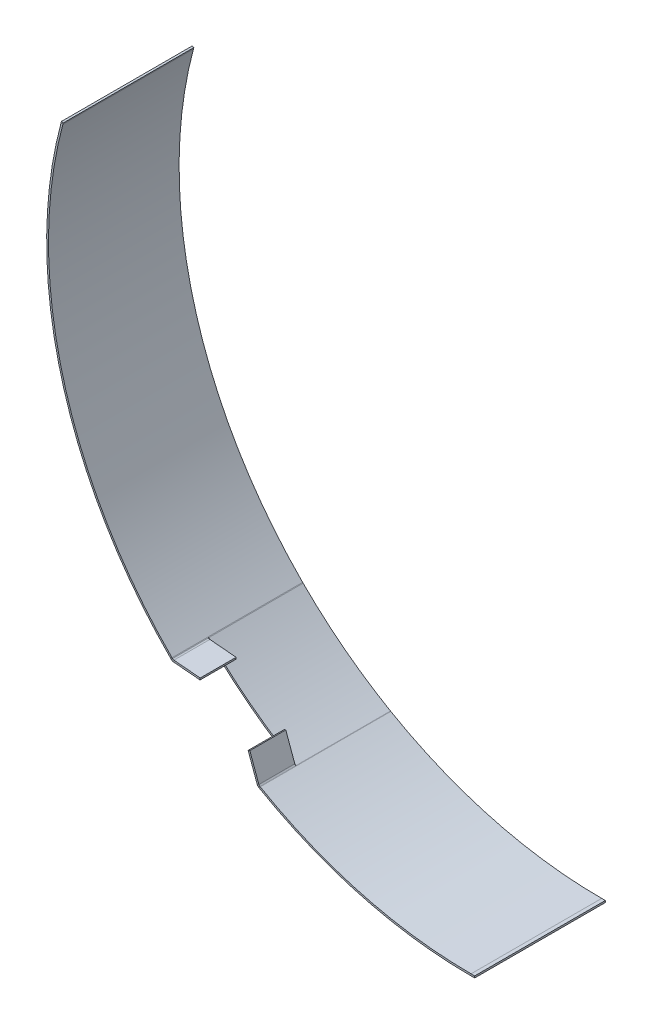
ISO-10303-21;
HEADER;
FILE_DESCRIPTION(('STEP AP214'),'2;1');
FILE_NAME('part.step','',(''),(''),'','','');
FILE_SCHEMA(('AUTOMOTIVE_DESIGN { 1 0 10303 214 1 1 1 1 }'));
ENDSEC;
DATA;
#1=APPLICATION_CONTEXT('core data for automotive mechanical design processes');
#2=APPLICATION_PROTOCOL_DEFINITION('international standard','automotive_design',2000,#1);
#3=PRODUCT_CONTEXT('',#1,'mechanical');
#4=PRODUCT('Part','Part','',(#3));
#5=PRODUCT_RELATED_PRODUCT_CATEGORY('part','',(#4));
#6=PRODUCT_DEFINITION_FORMATION('','',#4);
#7=PRODUCT_DEFINITION_CONTEXT('part definition',#1,'design');
#8=PRODUCT_DEFINITION('design','',#6,#7);
#9=PRODUCT_DEFINITION_SHAPE('','',#8);
#10=(LENGTH_UNIT() NAMED_UNIT(*) SI_UNIT(.MILLI.,.METRE.));
#11=(NAMED_UNIT(*) PLANE_ANGLE_UNIT() SI_UNIT($,.RADIAN.));
#12=(NAMED_UNIT(*) SI_UNIT($,.STERADIAN.) SOLID_ANGLE_UNIT());
#13=UNCERTAINTY_MEASURE_WITH_UNIT(LENGTH_MEASURE(1.E-05),#10,'distance_accuracy_value','');
#14=(GEOMETRIC_REPRESENTATION_CONTEXT(3) GLOBAL_UNCERTAINTY_ASSIGNED_CONTEXT((#13)) GLOBAL_UNIT_ASSIGNED_CONTEXT((#10,
#11,#12)) REPRESENTATION_CONTEXT('',''));
#15=CARTESIAN_POINT('',(0.,0.,0.));
#16=DIRECTION('',(0.,0.,1.));
#17=DIRECTION('',(1.,0.,0.));
#18=AXIS2_PLACEMENT_3D('',#15,#16,#17);
#19=CARTESIAN_POINT('',(-116.924774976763,-202.116025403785,88.9136379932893));
#20=DIRECTION('',(0.866025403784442,-0.499999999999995,0.));
#21=DIRECTION('',(0.499999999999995,0.866025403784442,0.));
#22=AXIS2_PLACEMENT_3D('',#19,#20,#21);
#23=PLANE('',#22);
#24=DIRECTION('',(-0.500000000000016,-0.866025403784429,0.));
#25=VECTOR('',#24,1.);
#26=CARTESIAN_POINT('',(-116.424774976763,-201.25,141.113637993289));
#27=LINE('',#26,#25);
#28=CARTESIAN_POINT('',(-116.424774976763,-201.25,141.113637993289));
#29=VERTEX_POINT('',#28);
#30=CARTESIAN_POINT('',(-116.924774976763,-202.116025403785,141.113637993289));
#31=VERTEX_POINT('',#30);
#32=EDGE_CURVE('E156',#29,#31,#27,.T.);
#33=ORIENTED_EDGE('',*,*,#32,.F.);
#34=DIRECTION('',(0.,0.,1.));
#35=VECTOR('',#34,1.);
#36=CARTESIAN_POINT('',(-116.424774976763,-201.25,88.9136379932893));
#37=LINE('',#36,#35);
#38=CARTESIAN_POINT('',(-116.424774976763,-201.25,140.913637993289));
#39=VERTEX_POINT('',#38);
#40=EDGE_CURVE('E480',#29,#39,#37,.F.);
#41=ORIENTED_EDGE('',*,*,#40,.T.);
#42=DIRECTION('',(-0.499999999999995,-0.866025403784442,0.));
#43=VECTOR('',#42,1.);
#44=CARTESIAN_POINT('',(-116.424774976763,-201.25,140.913637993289));
#45=LINE('',#44,#43);
#46=CARTESIAN_POINT('',(-116.924774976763,-202.116025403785,140.913637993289));
#47=VERTEX_POINT('',#46);
#48=EDGE_CURVE('E524',#39,#47,#45,.T.);
#49=ORIENTED_EDGE('',*,*,#48,.T.);
#50=DIRECTION('',(0.,0.,-1.));
#51=VECTOR('',#50,1.);
#52=CARTESIAN_POINT('',(-116.924774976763,-202.116025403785,88.9136379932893));
#53=LINE('',#52,#51);
#54=EDGE_CURVE('E496',#31,#47,#53,.T.);
#55=ORIENTED_EDGE('',*,*,#54,.F.);
#56=EDGE_LOOP('',(#33,#41,#49,#55));
#57=FACE_BOUND('',#56,.T.);
#58=ADVANCED_FACE('F131',(#57),#23,.F.);
#59=CARTESIAN_POINT('',(2.,-232.5,88.9136379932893));
#60=DIRECTION('',(0.,0.,1.));
#61=DIRECTION('',(1.,0.,0.));
#62=AXIS2_PLACEMENT_3D('',#59,#60,#61);
#63=PLANE('',#62);
#64=DIRECTION('',(0.,1.,0.));
#65=VECTOR('',#64,1.);
#66=CARTESIAN_POINT('',(0.,-232.5,88.9136379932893));
#67=LINE('',#66,#65);
#68=CARTESIAN_POINT('',(0.,-233.5,88.9136379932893));
#69=VERTEX_POINT('',#68);
#70=CARTESIAN_POINT('',(0.,-232.5,88.9136379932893));
#71=VERTEX_POINT('',#70);
#72=EDGE_CURVE('E463',#69,#71,#67,.T.);
#73=ORIENTED_EDGE('',*,*,#72,.T.);
#74=DIRECTION('',(-1.,0.,0.));
#75=VECTOR('',#74,1.);
#76=CARTESIAN_POINT('',(2.,-232.5,88.9136379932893));
#77=LINE('',#76,#75);
#78=CARTESIAN_POINT('',(2.,-232.5,88.9136379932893));
#79=VERTEX_POINT('',#78);
#80=EDGE_CURVE('E13',#79,#71,#77,.T.);
#81=ORIENTED_EDGE('',*,*,#80,.F.);
#82=DIRECTION('',(0.,1.,0.));
#83=VECTOR('',#82,1.);
#84=CARTESIAN_POINT('',(2.,-232.5,88.9136379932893));
#85=LINE('',#84,#83);
#86=CARTESIAN_POINT('',(2.,-233.5,88.9136379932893));
#87=VERTEX_POINT('',#86);
#88=EDGE_CURVE('E548',#87,#79,#85,.T.);
#89=ORIENTED_EDGE('',*,*,#88,.F.);
#90=DIRECTION('',(-1.,0.,0.));
#91=VECTOR('',#90,1.);
#92=CARTESIAN_POINT('',(2.,-233.5,88.9136379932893));
#93=LINE('',#92,#91);
#94=EDGE_CURVE('E471',#87,#69,#93,.T.);
#95=ORIENTED_EDGE('',*,*,#94,.T.);
#96=EDGE_LOOP('',(#73,#81,#89,#95));
#97=FACE_BOUND('',#96,.T.);
#98=ADVANCED_FACE('F133',(#97),#63,.F.);
#99=CARTESIAN_POINT('',(2.,-232.5,88.9136379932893));
#100=DIRECTION('',(0.,-1.,0.));
#101=DIRECTION('',(0.,0.,-1.));
#102=AXIS2_PLACEMENT_3D('',#99,#100,#101);
#103=PLANE('',#102);
#104=DIRECTION('',(0.,0.,1.));
#105=VECTOR('',#104,1.);
#106=CARTESIAN_POINT('',(0.,-232.5,88.9136379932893));
#107=LINE('',#106,#105);
#108=CARTESIAN_POINT('',(0.,-232.5,160.913637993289));
#109=VERTEX_POINT('',#108);
#110=EDGE_CURVE('E454',#71,#109,#107,.T.);
#111=ORIENTED_EDGE('',*,*,#110,.T.);
#112=DIRECTION('',(-1.,0.,0.));
#113=VECTOR('',#112,1.);
#114=CARTESIAN_POINT('',(2.,-232.5,160.913637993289));
#115=LINE('',#114,#113);
#116=CARTESIAN_POINT('',(2.,-232.5,160.913637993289));
#117=VERTEX_POINT('',#116);
#118=EDGE_CURVE('E140',#117,#109,#115,.T.);
#119=ORIENTED_EDGE('',*,*,#118,.F.);
#120=DIRECTION('',(0.,0.,1.));
#121=VECTOR('',#120,1.);
#122=CARTESIAN_POINT('',(2.,-232.5,88.9136379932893));
#123=LINE('',#122,#121);
#124=EDGE_CURVE('E551',#79,#117,#123,.T.);
#125=ORIENTED_EDGE('',*,*,#124,.F.);
#126=ORIENTED_EDGE('',*,*,#80,.T.);
#127=EDGE_LOOP('',(#111,#119,#125,#126));
#128=FACE_BOUND('',#127,.T.);
#129=ADVANCED_FACE('F408',(#128),#103,.F.);
#130=CARTESIAN_POINT('',(2.,-232.5,160.913637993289));
#131=DIRECTION('',(0.,0.,-1.));
#132=DIRECTION('',(-1.,0.,0.));
#133=AXIS2_PLACEMENT_3D('',#130,#131,#132);
#134=PLANE('',#133);
#135=DIRECTION('',(0.,-1.,0.));
#136=VECTOR('',#135,1.);
#137=CARTESIAN_POINT('',(0.,-232.5,160.913637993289));
#138=LINE('',#137,#136);
#139=CARTESIAN_POINT('',(0.,-233.5,160.913637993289));
#140=VERTEX_POINT('',#139);
#141=EDGE_CURVE('E462',#109,#140,#138,.T.);
#142=ORIENTED_EDGE('',*,*,#141,.T.);
#143=DIRECTION('',(-1.,0.,0.));
#144=VECTOR('',#143,1.);
#145=CARTESIAN_POINT('',(2.,-233.5,160.913637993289));
#146=LINE('',#145,#144);
#147=CARTESIAN_POINT('',(2.,-233.5,160.913637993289));
#148=VERTEX_POINT('',#147);
#149=EDGE_CURVE('E469',#148,#140,#146,.T.);
#150=ORIENTED_EDGE('',*,*,#149,.F.);
#151=DIRECTION('',(0.,-1.,0.));
#152=VECTOR('',#151,1.);
#153=CARTESIAN_POINT('',(2.,-232.5,160.913637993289));
#154=LINE('',#153,#152);
#155=EDGE_CURVE('E468',#117,#148,#154,.T.);
#156=ORIENTED_EDGE('',*,*,#155,.F.);
#157=ORIENTED_EDGE('',*,*,#118,.T.);
#158=EDGE_LOOP('',(#142,#150,#156,#157));
#159=FACE_BOUND('',#158,.T.);
#160=ADVANCED_FACE('F444',(#159),#134,.F.);
#161=CARTESIAN_POINT('',(2.,-233.5,88.9136379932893));
#162=DIRECTION('',(0.,1.,0.));
#163=DIRECTION('',(0.,0.,1.));
#164=AXIS2_PLACEMENT_3D('',#161,#162,#163);
#165=PLANE('',#164);
#166=DIRECTION('',(0.,0.,-1.));
#167=VECTOR('',#166,1.);
#168=CARTESIAN_POINT('',(0.,-233.5,88.9136379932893));
#169=LINE('',#168,#167);
#170=EDGE_CURVE('E545',#140,#69,#169,.T.);
#171=ORIENTED_EDGE('',*,*,#170,.T.);
#172=ORIENTED_EDGE('',*,*,#94,.F.);
#173=DIRECTION('',(0.,0.,-1.));
#174=VECTOR('',#173,1.);
#175=CARTESIAN_POINT('',(2.,-233.5,88.9136379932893));
#176=LINE('',#175,#174);
#177=EDGE_CURVE('E554',#148,#87,#176,.T.);
#178=ORIENTED_EDGE('',*,*,#177,.F.);
#179=ORIENTED_EDGE('',*,*,#149,.T.);
#180=EDGE_LOOP('',(#171,#172,#178,#179));
#181=FACE_BOUND('',#180,.T.);
#182=ADVANCED_FACE('F440',(#181),#165,.F.);
#183=CARTESIAN_POINT('',(2.,-233.5,88.9136379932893));
#184=DIRECTION('',(-1.,0.,0.));
#185=DIRECTION('',(0.,0.,1.));
#186=AXIS2_PLACEMENT_3D('',#183,#184,#185);
#187=PLANE('',#186);
#188=ORIENTED_EDGE('',*,*,#88,.T.);
#189=ORIENTED_EDGE('',*,*,#124,.T.);
#190=ORIENTED_EDGE('',*,*,#155,.T.);
#191=ORIENTED_EDGE('',*,*,#177,.T.);
#192=EDGE_LOOP('',(#188,#189,#190,#191));
#193=FACE_BOUND('',#192,.T.);
#194=ADVANCED_FACE('F433',(#193),#187,.F.);
#195=CARTESIAN_POINT('',(0.,0.,88.9136379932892));
#196=DIRECTION('',(0.,0.,-1.));
#197=DIRECTION('',(0.,1.,0.));
#198=AXIS2_PLACEMENT_3D('',#195,#196,#197);
#199=PLANE('',#198);
#200=DIRECTION('',(0.499999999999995,0.866025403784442,0.));
#201=VECTOR('',#200,1.);
#202=CARTESIAN_POINT('',(-116.749999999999,-202.216931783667,88.9136379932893));
#203=LINE('',#202,#201);
#204=CARTESIAN_POINT('',(-116.249999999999,-201.350906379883,88.9136379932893));
#205=VERTEX_POINT('',#204);
#206=CARTESIAN_POINT('',(-116.749999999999,-202.216931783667,88.9136379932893));
#207=VERTEX_POINT('',#206);
#208=EDGE_CURVE('E520',#205,#207,#203,.F.);
#209=ORIENTED_EDGE('',*,*,#208,.F.);
#210=CARTESIAN_POINT('',(0.,0.,88.9136379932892));
#211=DIRECTION('',(0.,0.,1.));
#212=DIRECTION('',(0.,-1.,0.));
#213=AXIS2_PLACEMENT_3D('',#210,#211,#212);
#214=CIRCLE('',#213,232.5);
#215=EDGE_CURVE('E533',#71,#205,#214,.F.);
#216=ORIENTED_EDGE('',*,*,#215,.F.);
#217=ORIENTED_EDGE('',*,*,#72,.F.);
#218=CARTESIAN_POINT('',(0.,0.,88.9136379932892));
#219=DIRECTION('',(0.,0.,1.));
#220=DIRECTION('',(0.,-1.,0.));
#221=AXIS2_PLACEMENT_3D('',#218,#219,#220);
#222=CIRCLE('',#221,233.5);
#223=EDGE_CURVE('E539',#69,#207,#222,.F.);
#224=ORIENTED_EDGE('',*,*,#223,.T.);
#225=EDGE_LOOP('',(#209,#216,#217,#224));
#226=FACE_BOUND('',#225,.T.);
#227=ADVANCED_FACE('F430',(#226),#199,.T.);
#228=CARTESIAN_POINT('',(0.,0.,160.913637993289));
#229=DIRECTION('',(0.,0.,-1.));
#230=DIRECTION('',(0.,1.,0.));
#231=AXIS2_PLACEMENT_3D('',#228,#229,#230);
#232=PLANE('',#231);
#233=CARTESIAN_POINT('',(0.,0.,160.913637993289));
#234=DIRECTION('',(0.,0.,1.));
#235=DIRECTION('',(0.,-1.,0.));
#236=AXIS2_PLACEMENT_3D('',#233,#234,#235);
#237=CIRCLE('',#236,232.5);
#238=CARTESIAN_POINT('',(-116.249999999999,-201.350906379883,160.913637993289));
#239=VERTEX_POINT('',#238);
#240=EDGE_CURVE('E536',#239,#109,#237,.T.);
#241=ORIENTED_EDGE('',*,*,#240,.F.);
#242=DIRECTION('',(0.499999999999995,0.866025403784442,0.));
#243=VECTOR('',#242,1.);
#244=CARTESIAN_POINT('',(-116.249999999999,-201.350906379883,160.913637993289));
#245=LINE('',#244,#243);
#246=CARTESIAN_POINT('',(-116.749999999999,-202.216931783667,160.913637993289));
#247=VERTEX_POINT('',#246);
#248=EDGE_CURVE('E526',#239,#247,#245,.F.);
#249=ORIENTED_EDGE('',*,*,#248,.T.);
#250=CARTESIAN_POINT('',(0.,0.,160.913637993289));
#251=DIRECTION('',(0.,0.,1.));
#252=DIRECTION('',(0.,-1.,0.));
#253=AXIS2_PLACEMENT_3D('',#250,#251,#252);
#254=CIRCLE('',#253,233.5);
#255=EDGE_CURVE('E535',#247,#140,#254,.T.);
#256=ORIENTED_EDGE('',*,*,#255,.T.);
#257=ORIENTED_EDGE('',*,*,#141,.F.);
#258=EDGE_LOOP('',(#241,#249,#256,#257));
#259=FACE_BOUND('',#258,.T.);
#260=ADVANCED_FACE('F426',(#259),#232,.F.);
#261=CARTESIAN_POINT('',(0.,0.,160.913637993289));
#262=DIRECTION('',(0.,0.,1.));
#263=DIRECTION('',(-0.499999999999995,-0.866025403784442,0.));
#264=AXIS2_PLACEMENT_3D('',#261,#262,#263);
#265=CYLINDRICAL_SURFACE('',#264,233.5);
#266=ORIENTED_EDGE('',*,*,#170,.F.);
#267=ORIENTED_EDGE('',*,*,#255,.F.);
#268=DIRECTION('',(0.,0.,1.));
#269=VECTOR('',#268,1.);
#270=CARTESIAN_POINT('',(-116.749999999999,-202.216931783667,88.9136379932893));
#271=LINE('',#270,#269);
#272=EDGE_CURVE('E513',#247,#207,#271,.F.);
#273=ORIENTED_EDGE('',*,*,#272,.T.);
#274=ORIENTED_EDGE('',*,*,#223,.F.);
#275=EDGE_LOOP('',(#266,#267,#273,#274));
#276=FACE_BOUND('',#275,.T.);
#277=ADVANCED_FACE('F424',(#276),#265,.T.);
#278=CARTESIAN_POINT('',(0.,0.,160.913637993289));
#279=DIRECTION('',(0.,0.,1.));
#280=DIRECTION('',(-0.499999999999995,-0.866025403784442,0.));
#281=AXIS2_PLACEMENT_3D('',#278,#279,#280);
#282=CYLINDRICAL_SURFACE('',#281,232.5);
#283=ORIENTED_EDGE('',*,*,#110,.F.);
#284=ORIENTED_EDGE('',*,*,#215,.T.);
#285=DIRECTION('',(0.,0.,1.));
#286=VECTOR('',#285,1.);
#287=CARTESIAN_POINT('',(-116.249999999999,-201.350906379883,88.9136379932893));
#288=LINE('',#287,#286);
#289=EDGE_CURVE('E523',#205,#239,#288,.T.);
#290=ORIENTED_EDGE('',*,*,#289,.T.);
#291=ORIENTED_EDGE('',*,*,#240,.T.);
#292=EDGE_LOOP('',(#283,#284,#290,#291));
#293=FACE_BOUND('',#292,.T.);
#294=ADVANCED_FACE('F420',(#293),#282,.F.);
#295=CARTESIAN_POINT('',(-62.7981872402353,-233.366025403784,88.9136379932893));
#296=DIRECTION('',(0.,0.,1.));
#297=DIRECTION('',(1.,0.,0.));
#298=AXIS2_PLACEMENT_3D('',#295,#296,#297);
#299=PLANE('',#298);
#300=ORIENTED_EDGE('',*,*,#208,.T.);
#301=DIRECTION('',(0.866025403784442,-0.499999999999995,0.));
#302=VECTOR('',#301,1.);
#303=CARTESIAN_POINT('',(-116.924774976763,-202.116025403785,88.9136379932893));
#304=LINE('',#303,#302);
#305=CARTESIAN_POINT('',(-116.924774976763,-202.116025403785,88.9136379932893));
#306=VERTEX_POINT('',#305);
#307=EDGE_CURVE('E479',#306,#207,#304,.T.);
#308=ORIENTED_EDGE('',*,*,#307,.F.);
#309=DIRECTION('',(0.499999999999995,0.866025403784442,0.));
#310=VECTOR('',#309,1.);
#311=CARTESIAN_POINT('',(-116.924774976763,-202.116025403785,88.9136379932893));
#312=LINE('',#311,#310);
#313=CARTESIAN_POINT('',(-116.424774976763,-201.25,88.9136379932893));
#314=VERTEX_POINT('',#313);
#315=EDGE_CURVE('E503',#306,#314,#312,.T.);
#316=ORIENTED_EDGE('',*,*,#315,.T.);
#317=DIRECTION('',(-0.866025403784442,0.499999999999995,0.));
#318=VECTOR('',#317,1.);
#319=CARTESIAN_POINT('',(-62.2981872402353,-232.5,88.9136379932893));
#320=LINE('',#319,#318);
#321=EDGE_CURVE('E521',#314,#205,#320,.F.);
#322=ORIENTED_EDGE('',*,*,#321,.T.);
#323=EDGE_LOOP('',(#300,#308,#316,#322));
#324=FACE_BOUND('',#323,.T.);
#325=ADVANCED_FACE('F416',(#324),#299,.F.);
#326=CARTESIAN_POINT('',(-116.924774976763,-202.116025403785,160.913637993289));
#327=DIRECTION('',(0.,0.,-1.));
#328=DIRECTION('',(-1.,0.,0.));
#329=AXIS2_PLACEMENT_3D('',#326,#327,#328);
#330=PLANE('',#329);
#331=ORIENTED_EDGE('',*,*,#248,.F.);
#332=DIRECTION('',(0.866025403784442,-0.499999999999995,0.));
#333=VECTOR('',#332,1.);
#334=CARTESIAN_POINT('',(-116.424774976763,-201.25,160.913637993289));
#335=LINE('',#334,#333);
#336=CARTESIAN_POINT('',(-116.424774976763,-201.25,160.913637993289));
#337=VERTEX_POINT('',#336);
#338=EDGE_CURVE('E488',#239,#337,#335,.F.);
#339=ORIENTED_EDGE('',*,*,#338,.T.);
#340=DIRECTION('',(0.499999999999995,0.866025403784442,0.));
#341=VECTOR('',#340,1.);
#342=CARTESIAN_POINT('',(-116.924774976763,-202.116025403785,160.913637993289));
#343=LINE('',#342,#341);
#344=CARTESIAN_POINT('',(-116.924774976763,-202.116025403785,160.913637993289));
#345=VERTEX_POINT('',#344);
#346=EDGE_CURVE('E538',#345,#337,#343,.T.);
#347=ORIENTED_EDGE('',*,*,#346,.F.);
#348=DIRECTION('',(-0.866025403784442,0.499999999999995,0.));
#349=VECTOR('',#348,1.);
#350=CARTESIAN_POINT('',(-116.924774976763,-202.116025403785,160.913637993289));
#351=LINE('',#350,#349);
#352=EDGE_CURVE('E498',#247,#345,#351,.T.);
#353=ORIENTED_EDGE('',*,*,#352,.F.);
#354=EDGE_LOOP('',(#331,#339,#347,#353));
#355=FACE_BOUND('',#354,.T.);
#356=ADVANCED_FACE('F414',(#355),#330,.F.);
#357=CARTESIAN_POINT('',(-116.924774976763,-202.116025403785,88.9136379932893));
#358=DIRECTION('',(0.499999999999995,0.866025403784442,0.));
#359=DIRECTION('',(-0.866025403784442,0.499999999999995,0.));
#360=AXIS2_PLACEMENT_3D('',#357,#358,#359);
#361=PLANE('',#360);
#362=ORIENTED_EDGE('',*,*,#272,.F.);
#363=ORIENTED_EDGE('',*,*,#352,.T.);
#364=EDGE_CURVE('E481',#345,#31,#53,.T.);
#365=ORIENTED_EDGE('',*,*,#364,.T.);
#366=ORIENTED_EDGE('',*,*,#54,.T.);
#367=DIRECTION('',(0.,0.,1.));
#368=VECTOR('',#367,1.);
#369=CARTESIAN_POINT('',(-116.924774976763,-202.116025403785,140.913637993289));
#370=LINE('',#369,#368);
#371=EDGE_CURVE('E515',#47,#306,#370,.F.);
#372=ORIENTED_EDGE('',*,*,#371,.T.);
#373=ORIENTED_EDGE('',*,*,#307,.T.);
#374=EDGE_LOOP('',(#362,#363,#365,#366,#372,#373));
#375=FACE_BOUND('',#374,.T.);
#376=ADVANCED_FACE('F412',(#375),#361,.F.);
#377=CARTESIAN_POINT('',(-116.424774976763,-201.25,88.9136379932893));
#378=DIRECTION('',(0.499999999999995,0.866025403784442,0.));
#379=DIRECTION('',(-0.866025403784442,0.499999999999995,0.));
#380=AXIS2_PLACEMENT_3D('',#377,#378,#379);
#381=PLANE('',#380);
#382=ORIENTED_EDGE('',*,*,#338,.F.);
#383=ORIENTED_EDGE('',*,*,#289,.F.);
#384=ORIENTED_EDGE('',*,*,#321,.F.);
#385=DIRECTION('',(0.,0.,1.));
#386=VECTOR('',#385,1.);
#387=CARTESIAN_POINT('',(-116.424774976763,-201.25,140.913637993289));
#388=LINE('',#387,#386);
#389=EDGE_CURVE('E631',#39,#314,#388,.F.);
#390=ORIENTED_EDGE('',*,*,#389,.F.);
#391=ORIENTED_EDGE('',*,*,#40,.F.);
#392=EDGE_CURVE('E475',#337,#29,#37,.F.);
#393=ORIENTED_EDGE('',*,*,#392,.F.);
#394=EDGE_LOOP('',(#382,#383,#384,#390,#391,#393));
#395=FACE_BOUND('',#394,.T.);
#396=ADVANCED_FACE('F570',(#395),#381,.T.);
#397=CARTESIAN_POINT('',(-0.17477497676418,0.100906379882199,88.9136379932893));
#398=DIRECTION('',(0.,0.,-1.));
#399=DIRECTION('',(-1.,0.,0.));
#400=AXIS2_PLACEMENT_3D('',#397,#398,#399);
#401=PLANE('',#400);
#402=DIRECTION('',(0.707106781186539,0.707106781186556,0.));
#403=VECTOR('',#402,1.);
#404=CARTESIAN_POINT('',(-165.284208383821,-165.008527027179,88.9136379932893));
#405=LINE('',#404,#403);
#406=CARTESIAN_POINT('',(-164.577101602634,-164.301420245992,88.9136379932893));
#407=VERTEX_POINT('',#406);
#408=CARTESIAN_POINT('',(-165.284208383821,-165.008527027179,88.9136379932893));
#409=VERTEX_POINT('',#408);
#410=EDGE_CURVE('E624',#407,#409,#405,.F.);
#411=ORIENTED_EDGE('',*,*,#410,.F.);
#412=CARTESIAN_POINT('',(-0.17477497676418,0.100906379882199,88.9136379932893));
#413=DIRECTION('',(0.,0.,1.));
#414=DIRECTION('',(1.,0.,0.));
#415=AXIS2_PLACEMENT_3D('',#412,#413,#414);
#416=CIRCLE('',#415,232.5);
#417=EDGE_CURVE('E627',#314,#407,#416,.F.);
#418=ORIENTED_EDGE('',*,*,#417,.F.);
#419=ORIENTED_EDGE('',*,*,#315,.F.);
#420=CARTESIAN_POINT('',(-0.17477497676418,0.100906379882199,88.9136379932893));
#421=DIRECTION('',(0.,0.,1.));
#422=DIRECTION('',(1.,0.,0.));
#423=AXIS2_PLACEMENT_3D('',#420,#421,#422);
#424=CIRCLE('',#423,233.5);
#425=EDGE_CURVE('E529',#306,#409,#424,.F.);
#426=ORIENTED_EDGE('',*,*,#425,.T.);
#427=EDGE_LOOP('',(#411,#418,#419,#426));
#428=FACE_BOUND('',#427,.T.);
#429=ADVANCED_FACE('F648',(#428),#401,.T.);
#430=CARTESIAN_POINT('',(-0.174774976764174,0.100906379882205,140.913637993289));
#431=DIRECTION('',(0.,0.,-1.));
#432=DIRECTION('',(-1.,0.,0.));
#433=AXIS2_PLACEMENT_3D('',#430,#431,#432);
#434=PLANE('',#433);
#435=CARTESIAN_POINT('',(-0.174774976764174,0.100906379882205,140.913637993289));
#436=DIRECTION('',(0.,0.,1.));
#437=DIRECTION('',(1.,0.,0.));
#438=AXIS2_PLACEMENT_3D('',#435,#436,#437);
#439=CIRCLE('',#438,232.5);
#440=CARTESIAN_POINT('',(-164.577101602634,-164.301420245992,140.913637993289));
#441=VERTEX_POINT('',#440);
#442=EDGE_CURVE('E604',#441,#39,#439,.T.);
#443=ORIENTED_EDGE('',*,*,#442,.F.);
#444=DIRECTION('',(0.707106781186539,0.707106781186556,0.));
#445=VECTOR('',#444,1.);
#446=CARTESIAN_POINT('',(-164.577101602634,-164.301420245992,140.913637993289));
#447=LINE('',#446,#445);
#448=CARTESIAN_POINT('',(-165.284208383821,-165.008527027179,140.913637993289));
#449=VERTEX_POINT('',#448);
#450=EDGE_CURVE('E618',#441,#449,#447,.F.);
#451=ORIENTED_EDGE('',*,*,#450,.T.);
#452=CARTESIAN_POINT('',(-0.174774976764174,0.100906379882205,140.913637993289));
#453=DIRECTION('',(0.,0.,1.));
#454=DIRECTION('',(1.,0.,0.));
#455=AXIS2_PLACEMENT_3D('',#452,#453,#454);
#456=CIRCLE('',#455,233.5);
#457=EDGE_CURVE('E630',#449,#47,#456,.T.);
#458=ORIENTED_EDGE('',*,*,#457,.T.);
#459=ORIENTED_EDGE('',*,*,#48,.F.);
#460=EDGE_LOOP('',(#443,#451,#458,#459));
#461=FACE_BOUND('',#460,.T.);
#462=ADVANCED_FACE('F1013',(#461),#434,.F.);
#463=CARTESIAN_POINT('',(-0.174774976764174,0.100906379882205,140.913637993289));
#464=DIRECTION('',(0.,0.,1.));
#465=DIRECTION('',(-0.707106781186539,-0.707106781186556,0.));
#466=AXIS2_PLACEMENT_3D('',#463,#464,#465);
#467=CYLINDRICAL_SURFACE('',#466,233.5);
#468=ORIENTED_EDGE('',*,*,#371,.F.);
#469=ORIENTED_EDGE('',*,*,#457,.F.);
#470=DIRECTION('',(0.,0.,1.));
#471=VECTOR('',#470,1.);
#472=CARTESIAN_POINT('',(-165.284208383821,-165.008527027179,88.9136379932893));
#473=LINE('',#472,#471);
#474=EDGE_CURVE('E616',#449,#409,#473,.F.);
#475=ORIENTED_EDGE('',*,*,#474,.T.);
#476=ORIENTED_EDGE('',*,*,#425,.F.);
#477=EDGE_LOOP('',(#468,#469,#475,#476));
#478=FACE_BOUND('',#477,.T.);
#479=ADVANCED_FACE('F1011',(#478),#467,.T.);
#480=CARTESIAN_POINT('',(-0.174774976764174,0.100906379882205,140.913637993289));
#481=DIRECTION('',(0.,0.,1.));
#482=DIRECTION('',(-0.707106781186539,-0.707106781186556,0.));
#483=AXIS2_PLACEMENT_3D('',#480,#481,#482);
#484=CYLINDRICAL_SURFACE('',#483,232.5);
#485=ORIENTED_EDGE('',*,*,#389,.T.);
#486=ORIENTED_EDGE('',*,*,#417,.T.);
#487=DIRECTION('',(0.,0.,1.));
#488=VECTOR('',#487,1.);
#489=CARTESIAN_POINT('',(-164.577101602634,-164.301420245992,88.9136379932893));
#490=LINE('',#489,#488);
#491=EDGE_CURVE('E621',#407,#441,#490,.T.);
#492=ORIENTED_EDGE('',*,*,#491,.T.);
#493=ORIENTED_EDGE('',*,*,#442,.T.);
#494=EDGE_LOOP('',(#485,#486,#492,#493));
#495=FACE_BOUND('',#494,.T.);
#496=ADVANCED_FACE('F644',(#495),#484,.F.);
#497=CARTESIAN_POINT('',(-143.640231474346,-186.652503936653,88.9136379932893));
#498=DIRECTION('',(0.,0.,1.));
#499=DIRECTION('',(1.,0.,0.));
#500=AXIS2_PLACEMENT_3D('',#497,#498,#499);
#501=PLANE('',#500);
#502=ORIENTED_EDGE('',*,*,#410,.T.);
#503=DIRECTION('',(0.707106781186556,-0.707106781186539,0.));
#504=VECTOR('',#503,1.);
#505=CARTESIAN_POINT('',(-143.640231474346,-186.652503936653,88.9136379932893));
#506=LINE('',#505,#504);
#507=CARTESIAN_POINT('',(-165.56054169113,-164.73219371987,88.9136379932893));
#508=VERTEX_POINT('',#507);
#509=EDGE_CURVE('E605',#508,#409,#506,.T.);
#510=ORIENTED_EDGE('',*,*,#509,.F.);
#511=DIRECTION('',(0.707106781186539,0.707106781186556,0.));
#512=VECTOR('',#511,1.);
#513=CARTESIAN_POINT('',(-165.56054169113,-164.73219371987,88.9136379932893));
#514=LINE('',#513,#512);
#515=CARTESIAN_POINT('',(-164.853434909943,-164.025086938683,88.9136379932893));
#516=VERTEX_POINT('',#515);
#517=EDGE_CURVE('E601',#508,#516,#514,.T.);
#518=ORIENTED_EDGE('',*,*,#517,.T.);
#519=DIRECTION('',(-0.707106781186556,0.707106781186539,0.));
#520=VECTOR('',#519,1.);
#521=CARTESIAN_POINT('',(-142.93312469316,-185.945397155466,88.9136379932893));
#522=LINE('',#521,#520);
#523=EDGE_CURVE('E611',#516,#407,#522,.F.);
#524=ORIENTED_EDGE('',*,*,#523,.T.);
#525=EDGE_LOOP('',(#502,#510,#518,#524));
#526=FACE_BOUND('',#525,.T.);
#527=ADVANCED_FACE('F652',(#526),#501,.F.);
#528=CARTESIAN_POINT('',(-143.640231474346,-186.652503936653,88.9136379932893));
#529=DIRECTION('',(0.707106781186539,0.707106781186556,0.));
#530=DIRECTION('',(-0.707106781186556,0.707106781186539,0.));
#531=AXIS2_PLACEMENT_3D('',#528,#529,#530);
#532=PLANE('',#531);
#533=ORIENTED_EDGE('',*,*,#474,.F.);
#534=DIRECTION('',(0.,0.,-1.));
#535=VECTOR('',#534,1.);
#536=CARTESIAN_POINT('',(-165.284208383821,-165.008527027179,160.913637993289));
#537=LINE('',#536,#535);
#538=CARTESIAN_POINT('',(-165.284208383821,-165.008527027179,141.113637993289));
#539=VERTEX_POINT('',#538);
#540=EDGE_CURVE('E703',#539,#449,#537,.T.);
#541=ORIENTED_EDGE('',*,*,#540,.F.);
#542=CARTESIAN_POINT('',(-165.284208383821,-165.008527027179,160.913637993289));
#543=VERTEX_POINT('',#542);
#544=EDGE_CURVE('E705',#543,#539,#537,.T.);
#545=ORIENTED_EDGE('',*,*,#544,.F.);
#546=DIRECTION('',(0.707106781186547,-0.707106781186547,0.));
#547=VECTOR('',#546,1.);
#548=CARTESIAN_POINT('',(-165.56054169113,-164.73219371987,160.913637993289));
#549=LINE('',#548,#547);
#550=CARTESIAN_POINT('',(-165.56054169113,-164.73219371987,160.913637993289));
#551=VERTEX_POINT('',#550);
#552=EDGE_CURVE('E661',#551,#543,#549,.T.);
#553=ORIENTED_EDGE('',*,*,#552,.F.);
#554=DIRECTION('',(0.,0.,-1.));
#555=VECTOR('',#554,1.);
#556=CARTESIAN_POINT('',(-165.56054169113,-164.73219371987,88.9136379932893));
#557=LINE('',#556,#555);
#558=EDGE_CURVE('E608',#551,#508,#557,.T.);
#559=ORIENTED_EDGE('',*,*,#558,.T.);
#560=ORIENTED_EDGE('',*,*,#509,.T.);
#561=EDGE_LOOP('',(#533,#541,#545,#553,#559,#560));
#562=FACE_BOUND('',#561,.T.);
#563=ADVANCED_FACE('F656',(#562),#532,.F.);
#564=CARTESIAN_POINT('',(-142.93312469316,-185.945397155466,88.9136379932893));
#565=DIRECTION('',(0.707106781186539,0.707106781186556,0.));
#566=DIRECTION('',(-0.707106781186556,0.707106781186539,0.));
#567=AXIS2_PLACEMENT_3D('',#564,#565,#566);
#568=PLANE('',#567);
#569=DIRECTION('',(0.,0.,1.));
#570=VECTOR('',#569,1.);
#571=CARTESIAN_POINT('',(-164.853434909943,-164.025086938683,88.9136379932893));
#572=LINE('',#571,#570);
#573=CARTESIAN_POINT('',(-164.853434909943,-164.025086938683,160.913637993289));
#574=VERTEX_POINT('',#573);
#575=EDGE_CURVE('E614',#574,#516,#572,.F.);
#576=ORIENTED_EDGE('',*,*,#575,.F.);
#577=DIRECTION('',(-0.707106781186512,0.707106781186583,0.));
#578=VECTOR('',#577,1.);
#579=CARTESIAN_POINT('',(-164.577101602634,-164.301420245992,160.913637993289));
#580=LINE('',#579,#578);
#581=CARTESIAN_POINT('',(-164.577101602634,-164.301420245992,160.913637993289));
#582=VERTEX_POINT('',#581);
#583=EDGE_CURVE('E686',#582,#574,#580,.T.);
#584=ORIENTED_EDGE('',*,*,#583,.F.);
#585=DIRECTION('',(0.,0.,-1.));
#586=VECTOR('',#585,1.);
#587=CARTESIAN_POINT('',(-164.577101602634,-164.301420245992,160.913637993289));
#588=LINE('',#587,#586);
#589=CARTESIAN_POINT('',(-164.577101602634,-164.301420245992,141.113637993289));
#590=VERTEX_POINT('',#589);
#591=EDGE_CURVE('E689',#582,#590,#588,.T.);
#592=ORIENTED_EDGE('',*,*,#591,.T.);
#593=EDGE_CURVE('E687',#590,#441,#588,.T.);
#594=ORIENTED_EDGE('',*,*,#593,.T.);
#595=ORIENTED_EDGE('',*,*,#491,.F.);
#596=ORIENTED_EDGE('',*,*,#523,.F.);
#597=EDGE_LOOP('',(#576,#584,#592,#594,#595,#596));
#598=FACE_BOUND('',#597,.T.);
#599=ADVANCED_FACE('F758',(#598),#568,.T.);
#600=CARTESIAN_POINT('',(-115.799774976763,-200.16746824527,141.113637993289));
#601=DIRECTION('',(0.,0.,-1.));
#602=DIRECTION('',(-1.,0.,0.));
#603=AXIS2_PLACEMENT_3D('',#600,#601,#602);
#604=PLANE('',#603);
#605=DIRECTION('',(0.939692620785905,0.34202014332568,0.));
#606=VECTOR('',#605,1.);
#607=CARTESIAN_POINT('',(-117.914083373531,-200.937013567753,141.113637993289));
#608=LINE('',#607,#606);
#609=CARTESIAN_POINT('',(-116.974390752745,-200.594993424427,141.113637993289));
#610=VERTEX_POINT('',#609);
#611=CARTESIAN_POINT('',(-117.914083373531,-200.937013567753,141.113637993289));
#612=VERTEX_POINT('',#611);
#613=EDGE_CURVE('E596',#610,#612,#608,.F.);
#614=ORIENTED_EDGE('',*,*,#613,.F.);
#615=CARTESIAN_POINT('',(-115.799774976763,-200.16746824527,141.113637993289));
#616=DIRECTION('',(0.,0.,1.));
#617=DIRECTION('',(1.,0.,0.));
#618=AXIS2_PLACEMENT_3D('',#615,#616,#617);
#619=CIRCLE('',#618,1.25000000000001);
#620=EDGE_CURVE('E587',#29,#610,#619,.F.);
#621=ORIENTED_EDGE('',*,*,#620,.F.);
#622=ORIENTED_EDGE('',*,*,#32,.T.);
#623=CARTESIAN_POINT('',(-115.799774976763,-200.16746824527,141.113637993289));
#624=DIRECTION('',(0.,0.,1.));
#625=DIRECTION('',(1.,0.,0.));
#626=AXIS2_PLACEMENT_3D('',#623,#624,#625);
#627=CIRCLE('',#626,2.25000000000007);
#628=EDGE_CURVE('E598',#31,#612,#627,.F.);
#629=ORIENTED_EDGE('',*,*,#628,.T.);
#630=EDGE_LOOP('',(#614,#621,#622,#629));
#631=FACE_BOUND('',#630,.T.);
#632=ADVANCED_FACE('F753',(#631),#604,.T.);
#633=CARTESIAN_POINT('',(-115.799774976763,-200.16746824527,160.913637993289));
#634=DIRECTION('',(0.,0.,-1.));
#635=DIRECTION('',(-1.,0.,0.));
#636=AXIS2_PLACEMENT_3D('',#633,#634,#635);
#637=PLANE('',#636);
#638=CARTESIAN_POINT('',(-115.799774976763,-200.16746824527,160.913637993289));
#639=DIRECTION('',(0.,0.,1.));
#640=DIRECTION('',(1.,0.,0.));
#641=AXIS2_PLACEMENT_3D('',#638,#639,#640);
#642=CIRCLE('',#641,1.25000000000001);
#643=CARTESIAN_POINT('',(-116.974390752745,-200.594993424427,160.913637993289));
#644=VERTEX_POINT('',#643);
#645=EDGE_CURVE('E581',#644,#337,#642,.T.);
#646=ORIENTED_EDGE('',*,*,#645,.F.);
#647=DIRECTION('',(0.939692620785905,0.34202014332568,0.));
#648=VECTOR('',#647,1.);
#649=CARTESIAN_POINT('',(-116.974390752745,-200.594993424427,160.913637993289));
#650=LINE('',#649,#648);
#651=CARTESIAN_POINT('',(-117.914083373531,-200.937013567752,160.913637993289));
#652=VERTEX_POINT('',#651);
#653=EDGE_CURVE('E713',#644,#652,#650,.F.);
#654=ORIENTED_EDGE('',*,*,#653,.T.);
#655=CARTESIAN_POINT('',(-115.799774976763,-200.16746824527,160.913637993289));
#656=DIRECTION('',(0.,0.,1.));
#657=DIRECTION('',(1.,0.,0.));
#658=AXIS2_PLACEMENT_3D('',#655,#656,#657);
#659=CIRCLE('',#658,2.25000000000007);
#660=EDGE_CURVE('E583',#652,#345,#659,.T.);
#661=ORIENTED_EDGE('',*,*,#660,.T.);
#662=ORIENTED_EDGE('',*,*,#346,.T.);
#663=EDGE_LOOP('',(#646,#654,#661,#662));
#664=FACE_BOUND('',#663,.T.);
#665=ADVANCED_FACE('F579',(#664),#637,.F.);
#666=CARTESIAN_POINT('',(-115.799774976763,-200.16746824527,160.913637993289));
#667=DIRECTION('',(0.,0.,1.));
#668=DIRECTION('',(-0.939692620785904,-0.34202014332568,0.));
#669=AXIS2_PLACEMENT_3D('',#666,#667,#668);
#670=CYLINDRICAL_SURFACE('',#669,2.25000000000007);
#671=ORIENTED_EDGE('',*,*,#364,.F.);
#672=ORIENTED_EDGE('',*,*,#660,.F.);
#673=DIRECTION('',(0.,0.,1.));
#674=VECTOR('',#673,1.);
#675=CARTESIAN_POINT('',(-117.914083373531,-200.937013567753,141.113637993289));
#676=LINE('',#675,#674);
#677=EDGE_CURVE('E714',#652,#612,#676,.F.);
#678=ORIENTED_EDGE('',*,*,#677,.T.);
#679=ORIENTED_EDGE('',*,*,#628,.F.);
#680=EDGE_LOOP('',(#671,#672,#678,#679));
#681=FACE_BOUND('',#680,.T.);
#682=ADVANCED_FACE('F751',(#681),#670,.T.);
#683=CARTESIAN_POINT('',(-115.799774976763,-200.16746824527,160.913637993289));
#684=DIRECTION('',(0.,0.,1.));
#685=DIRECTION('',(-0.939692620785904,-0.34202014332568,0.));
#686=AXIS2_PLACEMENT_3D('',#683,#684,#685);
#687=CYLINDRICAL_SURFACE('',#686,1.25000000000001);
#688=ORIENTED_EDGE('',*,*,#392,.T.);
#689=ORIENTED_EDGE('',*,*,#620,.T.);
#690=DIRECTION('',(0.,0.,1.));
#691=VECTOR('',#690,1.);
#692=CARTESIAN_POINT('',(-116.974390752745,-200.594993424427,141.113637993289));
#693=LINE('',#692,#691);
#694=EDGE_CURVE('E586',#610,#644,#693,.T.);
#695=ORIENTED_EDGE('',*,*,#694,.T.);
#696=ORIENTED_EDGE('',*,*,#645,.T.);
#697=EDGE_LOOP('',(#688,#689,#695,#696));
#698=FACE_BOUND('',#697,.T.);
#699=ADVANCED_FACE('F584',(#698),#687,.F.);
#700=CARTESIAN_POINT('',(-122.888779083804,-187.269149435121,160.913637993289));
#701=DIRECTION('',(0.,0.,-1.));
#702=DIRECTION('',(0.,1.,0.));
#703=AXIS2_PLACEMENT_3D('',#700,#701,#702);
#704=PLANE('',#703);
#705=ORIENTED_EDGE('',*,*,#653,.F.);
#706=DIRECTION('',(0.34202014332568,-0.939692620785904,0.));
#707=VECTOR('',#706,1.);
#708=CARTESIAN_POINT('',(-121.949086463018,-186.927129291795,160.913637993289));
#709=LINE('',#708,#707);
#710=CARTESIAN_POINT('',(-121.949086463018,-186.927129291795,160.913637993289));
#711=VERTEX_POINT('',#710);
#712=EDGE_CURVE('E718',#644,#711,#709,.F.);
#713=ORIENTED_EDGE('',*,*,#712,.T.);
#714=DIRECTION('',(0.939692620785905,0.342020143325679,0.));
#715=VECTOR('',#714,1.);
#716=CARTESIAN_POINT('',(-122.888779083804,-187.269149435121,160.913637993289));
#717=LINE('',#716,#715);
#718=CARTESIAN_POINT('',(-122.888779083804,-187.269149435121,160.913637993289));
#719=VERTEX_POINT('',#718);
#720=EDGE_CURVE('E588',#719,#711,#717,.T.);
#721=ORIENTED_EDGE('',*,*,#720,.F.);
#722=DIRECTION('',(-0.34202014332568,0.939692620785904,0.));
#723=VECTOR('',#722,1.);
#724=CARTESIAN_POINT('',(-117.758476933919,-201.36453874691,160.913637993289));
#725=LINE('',#724,#723);
#726=EDGE_CURVE('E724',#652,#719,#725,.T.);
#727=ORIENTED_EDGE('',*,*,#726,.F.);
#728=EDGE_LOOP('',(#705,#713,#721,#727));
#729=FACE_BOUND('',#728,.T.);
#730=ADVANCED_FACE('F742',(#729),#704,.F.);
#731=CARTESIAN_POINT('',(-117.758476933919,-201.36453874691,141.113637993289));
#732=DIRECTION('',(0.,0.,1.));
#733=DIRECTION('',(0.,-1.,0.));
#734=AXIS2_PLACEMENT_3D('',#731,#732,#733);
#735=PLANE('',#734);
#736=ORIENTED_EDGE('',*,*,#613,.T.);
#737=DIRECTION('',(0.34202014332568,-0.939692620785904,0.));
#738=VECTOR('',#737,1.);
#739=CARTESIAN_POINT('',(-117.758476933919,-201.36453874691,141.113637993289));
#740=LINE('',#739,#738);
#741=CARTESIAN_POINT('',(-122.888779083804,-187.269149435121,141.113637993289));
#742=VERTEX_POINT('',#741);
#743=EDGE_CURVE('E728',#742,#612,#740,.T.);
#744=ORIENTED_EDGE('',*,*,#743,.F.);
#745=DIRECTION('',(0.939692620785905,0.342020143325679,0.));
#746=VECTOR('',#745,1.);
#747=CARTESIAN_POINT('',(-122.888779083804,-187.269149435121,141.113637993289));
#748=LINE('',#747,#746);
#749=CARTESIAN_POINT('',(-121.949086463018,-186.927129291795,141.113637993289));
#750=VERTEX_POINT('',#749);
#751=EDGE_CURVE('E592',#742,#750,#748,.T.);
#752=ORIENTED_EDGE('',*,*,#751,.T.);
#753=DIRECTION('',(-0.34202014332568,0.939692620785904,0.));
#754=VECTOR('',#753,1.);
#755=CARTESIAN_POINT('',(-116.818784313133,-201.022518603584,141.113637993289));
#756=LINE('',#755,#754);
#757=EDGE_CURVE('E722',#750,#610,#756,.F.);
#758=ORIENTED_EDGE('',*,*,#757,.T.);
#759=EDGE_LOOP('',(#736,#744,#752,#758));
#760=FACE_BOUND('',#759,.T.);
#761=ADVANCED_FACE('F733',(#760),#735,.F.);
#762=CARTESIAN_POINT('',(-117.758476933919,-201.36453874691,141.113637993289));
#763=DIRECTION('',(0.939692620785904,0.34202014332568,0.));
#764=DIRECTION('',(-0.34202014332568,0.939692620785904,0.));
#765=AXIS2_PLACEMENT_3D('',#762,#763,#764);
#766=PLANE('',#765);
#767=ORIENTED_EDGE('',*,*,#677,.F.);
#768=ORIENTED_EDGE('',*,*,#726,.T.);
#769=DIRECTION('',(0.,0.,-1.));
#770=VECTOR('',#769,1.);
#771=CARTESIAN_POINT('',(-122.888779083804,-187.269149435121,141.113637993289));
#772=LINE('',#771,#770);
#773=EDGE_CURVE('E726',#719,#742,#772,.T.);
#774=ORIENTED_EDGE('',*,*,#773,.T.);
#775=ORIENTED_EDGE('',*,*,#743,.T.);
#776=EDGE_LOOP('',(#767,#768,#774,#775));
#777=FACE_BOUND('',#776,.T.);
#778=ADVANCED_FACE('F747',(#777),#766,.F.);
#779=CARTESIAN_POINT('',(-116.818784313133,-201.022518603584,141.113637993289));
#780=DIRECTION('',(0.939692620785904,0.34202014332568,0.));
#781=DIRECTION('',(-0.34202014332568,0.939692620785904,0.));
#782=AXIS2_PLACEMENT_3D('',#779,#780,#781);
#783=PLANE('',#782);
#784=ORIENTED_EDGE('',*,*,#712,.F.);
#785=ORIENTED_EDGE('',*,*,#694,.F.);
#786=ORIENTED_EDGE('',*,*,#757,.F.);
#787=DIRECTION('',(0.,0.,1.));
#788=VECTOR('',#787,1.);
#789=CARTESIAN_POINT('',(-121.949086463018,-186.927129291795,141.113637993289));
#790=LINE('',#789,#788);
#791=EDGE_CURVE('E720',#711,#750,#790,.F.);
#792=ORIENTED_EDGE('',*,*,#791,.F.);
#793=EDGE_LOOP('',(#784,#785,#786,#792));
#794=FACE_BOUND('',#793,.T.);
#795=ADVANCED_FACE('F739',(#794),#783,.T.);
#796=CARTESIAN_POINT('',(-122.888779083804,-187.269149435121,141.113637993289));
#797=DIRECTION('',(0.342020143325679,-0.939692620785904,0.));
#798=DIRECTION('',(0.939692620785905,0.342020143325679,0.));
#799=AXIS2_PLACEMENT_3D('',#796,#797,#798);
#800=PLANE('',#799);
#801=ORIENTED_EDGE('',*,*,#791,.T.);
#802=ORIENTED_EDGE('',*,*,#751,.F.);
#803=ORIENTED_EDGE('',*,*,#773,.F.);
#804=ORIENTED_EDGE('',*,*,#720,.T.);
#805=EDGE_LOOP('',(#801,#802,#803,#804));
#806=FACE_BOUND('',#805,.T.);
#807=ADVANCED_FACE('F744',(#806),#800,.F.);
#808=CARTESIAN_POINT('',(-165.284208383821,-165.008527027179,160.913637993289));
#809=DIRECTION('',(-0.70710678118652,0.707106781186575,0.));
#810=DIRECTION('',(-0.707106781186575,-0.70710678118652,0.));
#811=AXIS2_PLACEMENT_3D('',#808,#809,#810);
#812=PLANE('',#811);
#813=ORIENTED_EDGE('',*,*,#593,.F.);
#814=DIRECTION('',(-0.707106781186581,-0.707106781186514,0.));
#815=VECTOR('',#814,1.);
#816=CARTESIAN_POINT('',(-164.577101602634,-164.301420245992,141.113637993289));
#817=LINE('',#816,#815);
#818=EDGE_CURVE('E366',#590,#539,#817,.T.);
#819=ORIENTED_EDGE('',*,*,#818,.T.);
#820=ORIENTED_EDGE('',*,*,#540,.T.);
#821=ORIENTED_EDGE('',*,*,#450,.F.);
#822=EDGE_LOOP('',(#813,#819,#820,#821));
#823=FACE_BOUND('',#822,.T.);
#824=ADVANCED_FACE('F779',(#823),#812,.F.);
#825=CARTESIAN_POINT('',(-165.56054169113,-164.73219371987,160.913637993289));
#826=DIRECTION('',(0.,0.,-1.));
#827=DIRECTION('',(-1.,0.,0.));
#828=AXIS2_PLACEMENT_3D('',#825,#826,#827);
#829=PLANE('',#828);
#830=ORIENTED_EDGE('',*,*,#552,.T.);
#831=DIRECTION('',(0.707106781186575,0.70710678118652,0.));
#832=VECTOR('',#831,1.);
#833=CARTESIAN_POINT('',(-165.284208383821,-165.008527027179,160.913637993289));
#834=LINE('',#833,#832);
#835=EDGE_CURVE('E691',#543,#582,#834,.T.);
#836=ORIENTED_EDGE('',*,*,#835,.T.);
#837=ORIENTED_EDGE('',*,*,#583,.T.);
#838=DIRECTION('',(-0.707106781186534,-0.707106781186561,0.));
#839=VECTOR('',#838,1.);
#840=CARTESIAN_POINT('',(-164.853434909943,-164.025086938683,160.913637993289));
#841=LINE('',#840,#839);
#842=EDGE_CURVE('E674',#574,#551,#841,.T.);
#843=ORIENTED_EDGE('',*,*,#842,.T.);
#844=EDGE_LOOP('',(#830,#836,#837,#843));
#845=FACE_BOUND('',#844,.T.);
#846=ADVANCED_FACE('F683',(#845),#829,.F.);
#847=CARTESIAN_POINT('',(-0.451108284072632,0.377239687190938,88.9136379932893));
#848=DIRECTION('',(0.,0.,-1.));
#849=DIRECTION('',(-1.,0.,0.));
#850=AXIS2_PLACEMENT_3D('',#847,#848,#849);
#851=PLANE('',#850);
#852=DIRECTION('',(0.965925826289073,-0.258819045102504,0.));
#853=VECTOR('',#852,1.);
#854=CARTESIAN_POINT('',(-225.994788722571,60.8114867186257,88.9136379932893));
#855=LINE('',#854,#853);
#856=CARTESIAN_POINT('',(-225.028862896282,60.5526676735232,88.9136379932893));
#857=VERTEX_POINT('',#856);
#858=CARTESIAN_POINT('',(-225.994788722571,60.8114867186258,88.9136379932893));
#859=VERTEX_POINT('',#858);
#860=EDGE_CURVE('E374',#857,#859,#855,.F.);
#861=ORIENTED_EDGE('',*,*,#860,.F.);
#862=CARTESIAN_POINT('',(-0.451108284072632,0.377239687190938,88.9136379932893));
#863=DIRECTION('',(0.,0.,1.));
#864=DIRECTION('',(1.,0.,0.));
#865=AXIS2_PLACEMENT_3D('',#862,#863,#864);
#866=CIRCLE('',#865,232.5);
#867=EDGE_CURVE('E679',#516,#857,#866,.F.);
#868=ORIENTED_EDGE('',*,*,#867,.F.);
#869=ORIENTED_EDGE('',*,*,#517,.F.);
#870=CARTESIAN_POINT('',(-0.451108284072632,0.377239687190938,88.9136379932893));
#871=DIRECTION('',(0.,0.,1.));
#872=DIRECTION('',(1.,0.,0.));
#873=AXIS2_PLACEMENT_3D('',#870,#871,#872);
#874=CIRCLE('',#873,233.5);
#875=EDGE_CURVE('E668',#508,#859,#874,.F.);
#876=ORIENTED_EDGE('',*,*,#875,.T.);
#877=EDGE_LOOP('',(#861,#868,#869,#876));
#878=FACE_BOUND('',#877,.T.);
#879=ADVANCED_FACE('F791',(#878),#851,.T.);
#880=CARTESIAN_POINT('',(-0.451108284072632,0.377239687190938,160.913637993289));
#881=DIRECTION('',(0.,0.,-1.));
#882=DIRECTION('',(-1.,0.,0.));
#883=AXIS2_PLACEMENT_3D('',#880,#881,#882);
#884=PLANE('',#883);
#885=CARTESIAN_POINT('',(-0.451108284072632,0.377239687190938,160.913637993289));
#886=DIRECTION('',(0.,0.,1.));
#887=DIRECTION('',(1.,0.,0.));
#888=AXIS2_PLACEMENT_3D('',#885,#886,#887);
#889=CIRCLE('',#888,232.5);
#890=CARTESIAN_POINT('',(-225.028862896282,60.5526676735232,160.913637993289));
#891=VERTEX_POINT('',#890);
#892=EDGE_CURVE('E1150',#891,#574,#889,.T.);
#893=ORIENTED_EDGE('',*,*,#892,.F.);
#894=DIRECTION('',(0.965925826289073,-0.258819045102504,0.));
#895=VECTOR('',#894,1.);
#896=CARTESIAN_POINT('',(-225.028862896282,60.5526676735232,160.913637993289));
#897=LINE('',#896,#895);
#898=CARTESIAN_POINT('',(-225.994788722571,60.8114867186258,160.913637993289));
#899=VERTEX_POINT('',#898);
#900=EDGE_CURVE('E677',#891,#899,#897,.F.);
#901=ORIENTED_EDGE('',*,*,#900,.T.);
#902=CARTESIAN_POINT('',(-0.451108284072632,0.377239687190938,160.913637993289));
#903=DIRECTION('',(0.,0.,1.));
#904=DIRECTION('',(1.,0.,0.));
#905=AXIS2_PLACEMENT_3D('',#902,#903,#904);
#906=CIRCLE('',#905,233.5);
#907=EDGE_CURVE('E665',#899,#551,#906,.T.);
#908=ORIENTED_EDGE('',*,*,#907,.T.);
#909=ORIENTED_EDGE('',*,*,#842,.F.);
#910=EDGE_LOOP('',(#893,#901,#908,#909));
#911=FACE_BOUND('',#910,.T.);
#912=ADVANCED_FACE('F673',(#911),#884,.F.);
#913=CARTESIAN_POINT('',(-0.451108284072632,0.377239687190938,160.913637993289));
#914=DIRECTION('',(0.,0.,1.));
#915=DIRECTION('',(-0.965925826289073,0.258819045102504,0.));
#916=AXIS2_PLACEMENT_3D('',#913,#914,#915);
#917=CYLINDRICAL_SURFACE('',#916,233.5);
#918=ORIENTED_EDGE('',*,*,#558,.F.);
#919=ORIENTED_EDGE('',*,*,#907,.F.);
#920=DIRECTION('',(0.,0.,1.));
#921=VECTOR('',#920,1.);
#922=CARTESIAN_POINT('',(-225.994788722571,60.8114867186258,88.9136379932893));
#923=LINE('',#922,#921);
#924=EDGE_CURVE('E1159',#899,#859,#923,.F.);
#925=ORIENTED_EDGE('',*,*,#924,.T.);
#926=ORIENTED_EDGE('',*,*,#875,.F.);
#927=EDGE_LOOP('',(#918,#919,#925,#926));
#928=FACE_BOUND('',#927,.T.);
#929=ADVANCED_FACE('F664',(#928),#917,.T.);
#930=CARTESIAN_POINT('',(-0.451108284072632,0.377239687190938,160.913637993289));
#931=DIRECTION('',(0.,0.,1.));
#932=DIRECTION('',(-0.965925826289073,0.258819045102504,0.));
#933=AXIS2_PLACEMENT_3D('',#930,#931,#932);
#934=CYLINDRICAL_SURFACE('',#933,232.5);
#935=ORIENTED_EDGE('',*,*,#575,.T.);
#936=ORIENTED_EDGE('',*,*,#867,.T.);
#937=DIRECTION('',(0.,0.,1.));
#938=VECTOR('',#937,1.);
#939=CARTESIAN_POINT('',(-225.028862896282,60.5526676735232,88.9136379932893));
#940=LINE('',#939,#938);
#941=EDGE_CURVE('E1156',#857,#891,#940,.T.);
#942=ORIENTED_EDGE('',*,*,#941,.T.);
#943=ORIENTED_EDGE('',*,*,#892,.T.);
#944=EDGE_LOOP('',(#935,#936,#942,#943));
#945=FACE_BOUND('',#944,.T.);
#946=ADVANCED_FACE('F794',(#945),#934,.F.);
#947=CARTESIAN_POINT('',(-225.796517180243,61.5514461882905,160.913637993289));
#948=DIRECTION('',(0.,0.,-1.));
#949=DIRECTION('',(-1.,0.,0.));
#950=AXIS2_PLACEMENT_3D('',#947,#948,#949);
#951=PLANE('',#950);
#952=ORIENTED_EDGE('',*,*,#900,.F.);
#953=DIRECTION('',(-0.258819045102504,-0.965925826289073,0.));
#954=VECTOR('',#953,1.);
#955=CARTESIAN_POINT('',(-224.830591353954,61.2926271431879,160.913637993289));
#956=LINE('',#955,#954);
#957=CARTESIAN_POINT('',(-224.830591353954,61.2926271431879,160.913637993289));
#958=VERTEX_POINT('',#957);
#959=EDGE_CURVE('E1161',#891,#958,#956,.F.);
#960=ORIENTED_EDGE('',*,*,#959,.T.);
#961=DIRECTION('',(0.965925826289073,-0.258819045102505,0.));
#962=VECTOR('',#961,1.);
#963=CARTESIAN_POINT('',(-225.796517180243,61.5514461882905,160.913637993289));
#964=LINE('',#963,#962);
#965=CARTESIAN_POINT('',(-225.796517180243,61.5514461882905,160.913637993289));
#966=VERTEX_POINT('',#965);
#967=EDGE_CURVE('E369',#966,#958,#964,.T.);
#968=ORIENTED_EDGE('',*,*,#967,.F.);
#969=DIRECTION('',(0.258819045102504,0.965925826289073,0.));
#970=VECTOR('',#969,1.);
#971=CARTESIAN_POINT('',(-260.737088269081,-68.8485403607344,160.913637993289));
#972=LINE('',#971,#970);
#973=EDGE_CURVE('E1168',#899,#966,#972,.T.);
#974=ORIENTED_EDGE('',*,*,#973,.F.);
#975=EDGE_LOOP('',(#952,#960,#968,#974));
#976=FACE_BOUND('',#975,.T.);
#977=ADVANCED_FACE('F802',(#976),#951,.F.);
#978=CARTESIAN_POINT('',(-260.737088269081,-68.8485403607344,88.9136379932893));
#979=DIRECTION('',(0.,0.,1.));
#980=DIRECTION('',(1.,0.,0.));
#981=AXIS2_PLACEMENT_3D('',#978,#979,#980);
#982=PLANE('',#981);
#983=ORIENTED_EDGE('',*,*,#860,.T.);
#984=DIRECTION('',(-0.258819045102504,-0.965925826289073,0.));
#985=VECTOR('',#984,1.);
#986=CARTESIAN_POINT('',(-260.737088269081,-68.8485403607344,88.9136379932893));
#987=LINE('',#986,#985);
#988=CARTESIAN_POINT('',(-225.796517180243,61.5514461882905,88.9136379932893));
#989=VERTEX_POINT('',#988);
#990=EDGE_CURVE('E1172',#989,#859,#987,.T.);
#991=ORIENTED_EDGE('',*,*,#990,.F.);
#992=DIRECTION('',(0.965925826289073,-0.258819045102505,0.));
#993=VECTOR('',#992,1.);
#994=CARTESIAN_POINT('',(-225.796517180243,61.5514461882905,88.9136379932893));
#995=LINE('',#994,#993);
#996=CARTESIAN_POINT('',(-224.830591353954,61.2926271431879,88.9136379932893));
#997=VERTEX_POINT('',#996);
#998=EDGE_CURVE('E1174',#989,#997,#995,.T.);
#999=ORIENTED_EDGE('',*,*,#998,.T.);
#1000=DIRECTION('',(0.258819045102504,0.965925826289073,0.));
#1001=VECTOR('',#1000,1.);
#1002=CARTESIAN_POINT('',(-259.771162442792,-69.1073594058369,88.9136379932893));
#1003=LINE('',#1002,#1001);
#1004=EDGE_CURVE('E1165',#997,#857,#1003,.F.);
#1005=ORIENTED_EDGE('',*,*,#1004,.T.);
#1006=EDGE_LOOP('',(#983,#991,#999,#1005));
#1007=FACE_BOUND('',#1006,.T.);
#1008=ADVANCED_FACE('F806',(#1007),#982,.F.);
#1009=CARTESIAN_POINT('',(-260.737088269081,-68.8485403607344,88.9136379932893));
#1010=DIRECTION('',(0.965925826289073,-0.258819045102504,0.));
#1011=DIRECTION('',(0.258819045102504,0.965925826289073,0.));
#1012=AXIS2_PLACEMENT_3D('',#1009,#1010,#1011);
#1013=PLANE('',#1012);
#1014=ORIENTED_EDGE('',*,*,#924,.F.);
#1015=ORIENTED_EDGE('',*,*,#973,.T.);
#1016=DIRECTION('',(0.,0.,-1.));
#1017=VECTOR('',#1016,1.);
#1018=CARTESIAN_POINT('',(-225.796517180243,61.5514461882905,88.9136379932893));
#1019=LINE('',#1018,#1017);
#1020=EDGE_CURVE('E1170',#966,#989,#1019,.T.);
#1021=ORIENTED_EDGE('',*,*,#1020,.T.);
#1022=ORIENTED_EDGE('',*,*,#990,.T.);
#1023=EDGE_LOOP('',(#1014,#1015,#1021,#1022));
#1024=FACE_BOUND('',#1023,.T.);
#1025=ADVANCED_FACE('F816',(#1024),#1013,.F.);
#1026=CARTESIAN_POINT('',(-259.771162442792,-69.1073594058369,88.9136379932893));
#1027=DIRECTION('',(0.965925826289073,-0.258819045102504,0.));
#1028=DIRECTION('',(0.258819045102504,0.965925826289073,0.));
#1029=AXIS2_PLACEMENT_3D('',#1026,#1027,#1028);
#1030=PLANE('',#1029);
#1031=ORIENTED_EDGE('',*,*,#959,.F.);
#1032=ORIENTED_EDGE('',*,*,#941,.F.);
#1033=ORIENTED_EDGE('',*,*,#1004,.F.);
#1034=DIRECTION('',(0.,0.,1.));
#1035=VECTOR('',#1034,1.);
#1036=CARTESIAN_POINT('',(-224.830591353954,61.2926271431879,88.9136379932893));
#1037=LINE('',#1036,#1035);
#1038=EDGE_CURVE('E1163',#958,#997,#1037,.F.);
#1039=ORIENTED_EDGE('',*,*,#1038,.F.);
#1040=EDGE_LOOP('',(#1031,#1032,#1033,#1039));
#1041=FACE_BOUND('',#1040,.T.);
#1042=ADVANCED_FACE('F812',(#1041),#1030,.T.);
#1043=CARTESIAN_POINT('',(-225.796517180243,61.5514461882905,88.9136379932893));
#1044=DIRECTION('',(-0.258819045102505,-0.965925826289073,0.));
#1045=DIRECTION('',(0.965925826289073,-0.258819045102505,0.));
#1046=AXIS2_PLACEMENT_3D('',#1043,#1044,#1045);
#1047=PLANE('',#1046);
#1048=ORIENTED_EDGE('',*,*,#1038,.T.);
#1049=ORIENTED_EDGE('',*,*,#998,.F.);
#1050=ORIENTED_EDGE('',*,*,#1020,.F.);
#1051=ORIENTED_EDGE('',*,*,#967,.T.);
#1052=EDGE_LOOP('',(#1048,#1049,#1050,#1051));
#1053=FACE_BOUND('',#1052,.T.);
#1054=ADVANCED_FACE('F808',(#1053),#1047,.F.);
#1055=CARTESIAN_POINT('',(-163.693218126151,-163.417536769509,160.913637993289));
#1056=DIRECTION('',(0.,0.,1.));
#1057=DIRECTION('',(1.,0.,0.));
#1058=AXIS2_PLACEMENT_3D('',#1055,#1056,#1057);
#1059=PLANE('',#1058);
#1060=DIRECTION('',(0.0871557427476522,0.996194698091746,0.));
#1061=VECTOR('',#1060,1.);
#1062=CARTESIAN_POINT('',(-163.889318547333,-165.658974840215,160.913637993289));
#1063=LINE('',#1062,#1061);
#1064=CARTESIAN_POINT('',(-163.802162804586,-164.662780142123,160.913637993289));
#1065=VERTEX_POINT('',#1064);
#1066=CARTESIAN_POINT('',(-163.889318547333,-165.658974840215,160.913637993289));
#1067=VERTEX_POINT('',#1066);
#1068=EDGE_CURVE('E343',#1065,#1067,#1063,.F.);
#1069=ORIENTED_EDGE('',*,*,#1068,.F.);
#1070=CARTESIAN_POINT('',(-163.693218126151,-163.417536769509,160.913637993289));
#1071=DIRECTION('',(0.,0.,-1.));
#1072=DIRECTION('',(-1.,0.,0.));
#1073=AXIS2_PLACEMENT_3D('',#1070,#1071,#1072);
#1074=CIRCLE('',#1073,1.2499999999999);
#1075=EDGE_CURVE('E359',#582,#1065,#1074,.F.);
#1076=ORIENTED_EDGE('',*,*,#1075,.F.);
#1077=ORIENTED_EDGE('',*,*,#835,.F.);
#1078=CARTESIAN_POINT('',(-163.693218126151,-163.417536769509,160.913637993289));
#1079=DIRECTION('',(0.,0.,-1.));
#1080=DIRECTION('',(-1.,0.,0.));
#1081=AXIS2_PLACEMENT_3D('',#1078,#1079,#1080);
#1082=CIRCLE('',#1081,2.24999999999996);
#1083=EDGE_CURVE('E363',#543,#1067,#1082,.F.);
#1084=ORIENTED_EDGE('',*,*,#1083,.T.);
#1085=EDGE_LOOP('',(#1069,#1076,#1077,#1084));
#1086=FACE_BOUND('',#1085,.T.);
#1087=ADVANCED_FACE('F811',(#1086),#1059,.T.);
#1088=CARTESIAN_POINT('',(-163.693218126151,-163.417536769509,141.113637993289));
#1089=DIRECTION('',(0.,0.,1.));
#1090=DIRECTION('',(1.,0.,0.));
#1091=AXIS2_PLACEMENT_3D('',#1088,#1089,#1090);
#1092=PLANE('',#1091);
#1093=CARTESIAN_POINT('',(-163.693218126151,-163.417536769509,141.113637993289));
#1094=DIRECTION('',(0.,0.,-1.));
#1095=DIRECTION('',(-1.,0.,0.));
#1096=AXIS2_PLACEMENT_3D('',#1093,#1094,#1095);
#1097=CIRCLE('',#1096,1.2499999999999);
#1098=CARTESIAN_POINT('',(-163.802162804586,-164.662780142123,141.113637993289));
#1099=VERTEX_POINT('',#1098);
#1100=EDGE_CURVE('E362',#1099,#590,#1097,.T.);
#1101=ORIENTED_EDGE('',*,*,#1100,.F.);
#1102=DIRECTION('',(0.0871557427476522,0.996194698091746,0.));
#1103=VECTOR('',#1102,1.);
#1104=CARTESIAN_POINT('',(-163.802162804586,-164.662780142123,141.113637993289));
#1105=LINE('',#1104,#1103);
#1106=CARTESIAN_POINT('',(-163.889318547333,-165.658974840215,141.113637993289));
#1107=VERTEX_POINT('',#1106);
#1108=EDGE_CURVE('E354',#1099,#1107,#1105,.F.);
#1109=ORIENTED_EDGE('',*,*,#1108,.T.);
#1110=CARTESIAN_POINT('',(-163.693218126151,-163.417536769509,141.113637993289));
#1111=DIRECTION('',(0.,0.,-1.));
#1112=DIRECTION('',(-1.,0.,0.));
#1113=AXIS2_PLACEMENT_3D('',#1110,#1111,#1112);
#1114=CIRCLE('',#1113,2.24999999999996);
#1115=EDGE_CURVE('E148',#1107,#539,#1114,.T.);
#1116=ORIENTED_EDGE('',*,*,#1115,.T.);
#1117=ORIENTED_EDGE('',*,*,#818,.F.);
#1118=EDGE_LOOP('',(#1101,#1109,#1116,#1117));
#1119=FACE_BOUND('',#1118,.T.);
#1120=ADVANCED_FACE('F390',(#1119),#1092,.F.);
#1121=CARTESIAN_POINT('',(-163.693218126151,-163.417536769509,141.113637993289));
#1122=DIRECTION('',(0.,0.,-1.));
#1123=DIRECTION('',(-0.0871557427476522,-0.996194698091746,0.));
#1124=AXIS2_PLACEMENT_3D('',#1121,#1122,#1123);
#1125=CYLINDRICAL_SURFACE('',#1124,2.24999999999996);
#1126=ORIENTED_EDGE('',*,*,#544,.T.);
#1127=ORIENTED_EDGE('',*,*,#1115,.F.);
#1128=DIRECTION('',(0.,0.,-1.));
#1129=VECTOR('',#1128,1.);
#1130=CARTESIAN_POINT('',(-163.889318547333,-165.658974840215,160.913637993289));
#1131=LINE('',#1130,#1129);
#1132=EDGE_CURVE('E352',#1107,#1067,#1131,.F.);
#1133=ORIENTED_EDGE('',*,*,#1132,.T.);
#1134=ORIENTED_EDGE('',*,*,#1083,.F.);
#1135=EDGE_LOOP('',(#1126,#1127,#1133,#1134));
#1136=FACE_BOUND('',#1135,.T.);
#1137=ADVANCED_FACE('F826',(#1136),#1125,.T.);
#1138=CARTESIAN_POINT('',(-163.693218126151,-163.417536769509,141.113637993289));
#1139=DIRECTION('',(0.,0.,-1.));
#1140=DIRECTION('',(-0.0871557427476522,-0.996194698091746,0.));
#1141=AXIS2_PLACEMENT_3D('',#1138,#1139,#1140);
#1142=CYLINDRICAL_SURFACE('',#1141,1.2499999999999);
#1143=ORIENTED_EDGE('',*,*,#591,.F.);
#1144=ORIENTED_EDGE('',*,*,#1075,.T.);
#1145=DIRECTION('',(0.,0.,-1.));
#1146=VECTOR('',#1145,1.);
#1147=CARTESIAN_POINT('',(-163.802162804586,-164.662780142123,160.913637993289));
#1148=LINE('',#1147,#1146);
#1149=EDGE_CURVE('E356',#1065,#1099,#1148,.T.);
#1150=ORIENTED_EDGE('',*,*,#1149,.T.);
#1151=ORIENTED_EDGE('',*,*,#1100,.T.);
#1152=EDGE_LOOP('',(#1143,#1144,#1150,#1151));
#1153=FACE_BOUND('',#1152,.T.);
#1154=ADVANCED_FACE('F387',(#1153),#1142,.F.);
#1155=CARTESIAN_POINT('',(-164.342550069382,-165.619322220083,160.913637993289));
#1156=DIRECTION('',(0.,0.,-1.));
#1157=DIRECTION('',(-1.,0.,0.));
#1158=AXIS2_PLACEMENT_3D('',#1155,#1156,#1157);
#1159=PLANE('',#1158);
#1160=ORIENTED_EDGE('',*,*,#1068,.T.);
#1161=DIRECTION('',(-0.996194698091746,0.0871557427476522,0.));
#1162=VECTOR('',#1161,1.);
#1163=CARTESIAN_POINT('',(-149.399629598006,-166.926658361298,160.913637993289));
#1164=LINE('',#1163,#1162);
#1165=CARTESIAN_POINT('',(-149.399629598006,-166.926658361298,160.913637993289));
#1166=VERTEX_POINT('',#1165);
#1167=EDGE_CURVE('E324',#1166,#1067,#1164,.T.);
#1168=ORIENTED_EDGE('',*,*,#1167,.F.);
#1169=DIRECTION('',(0.0871557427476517,0.996194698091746,0.));
#1170=VECTOR('',#1169,1.);
#1171=CARTESIAN_POINT('',(-149.399629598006,-166.926658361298,160.913637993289));
#1172=LINE('',#1171,#1170);
#1173=CARTESIAN_POINT('',(-149.312473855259,-165.930463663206,160.913637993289));
#1174=VERTEX_POINT('',#1173);
#1175=EDGE_CURVE('E330',#1166,#1174,#1172,.T.);
#1176=ORIENTED_EDGE('',*,*,#1175,.T.);
#1177=DIRECTION('',(0.996194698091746,-0.0871557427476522,0.));
#1178=VECTOR('',#1177,1.);
#1179=CARTESIAN_POINT('',(-164.255394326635,-164.623127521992,160.913637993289));
#1180=LINE('',#1179,#1178);
#1181=EDGE_CURVE('E350',#1174,#1065,#1180,.F.);
#1182=ORIENTED_EDGE('',*,*,#1181,.T.);
#1183=EDGE_LOOP('',(#1160,#1168,#1176,#1182));
#1184=FACE_BOUND('',#1183,.T.);
#1185=ADVANCED_FACE('F342',(#1184),#1159,.F.);
#1186=CARTESIAN_POINT('',(-149.399629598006,-166.926658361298,141.113637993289));
#1187=DIRECTION('',(0.,0.,1.));
#1188=DIRECTION('',(1.,0.,0.));
#1189=AXIS2_PLACEMENT_3D('',#1186,#1187,#1188);
#1190=PLANE('',#1189);
#1191=ORIENTED_EDGE('',*,*,#1108,.F.);
#1192=DIRECTION('',(-0.996194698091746,0.0871557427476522,0.));
#1193=VECTOR('',#1192,1.);
#1194=CARTESIAN_POINT('',(-149.312473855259,-165.930463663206,141.113637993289));
#1195=LINE('',#1194,#1193);
#1196=CARTESIAN_POINT('',(-149.312473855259,-165.930463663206,141.113637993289));
#1197=VERTEX_POINT('',#1196);
#1198=EDGE_CURVE('E346',#1099,#1197,#1195,.F.);
#1199=ORIENTED_EDGE('',*,*,#1198,.T.);
#1200=DIRECTION('',(0.0871557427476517,0.996194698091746,0.));
#1201=VECTOR('',#1200,1.);
#1202=CARTESIAN_POINT('',(-149.399629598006,-166.926658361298,141.113637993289));
#1203=LINE('',#1202,#1201);
#1204=CARTESIAN_POINT('',(-149.399629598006,-166.926658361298,141.113637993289));
#1205=VERTEX_POINT('',#1204);
#1206=EDGE_CURVE('E339',#1205,#1197,#1203,.T.);
#1207=ORIENTED_EDGE('',*,*,#1206,.F.);
#1208=DIRECTION('',(0.996194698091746,-0.0871557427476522,0.));
#1209=VECTOR('',#1208,1.);
#1210=CARTESIAN_POINT('',(-149.399629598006,-166.926658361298,141.113637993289));
#1211=LINE('',#1210,#1209);
#1212=EDGE_CURVE('E326',#1107,#1205,#1211,.T.);
#1213=ORIENTED_EDGE('',*,*,#1212,.F.);
#1214=EDGE_LOOP('',(#1191,#1199,#1207,#1213));
#1215=FACE_BOUND('',#1214,.T.);
#1216=ADVANCED_FACE('F391',(#1215),#1190,.F.);
#1217=CARTESIAN_POINT('',(-149.399629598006,-166.926658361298,160.913637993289));
#1218=DIRECTION('',(0.0871557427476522,0.996194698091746,0.));
#1219=DIRECTION('',(-0.996194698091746,0.0871557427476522,0.));
#1220=AXIS2_PLACEMENT_3D('',#1217,#1218,#1219);
#1221=PLANE('',#1220);
#1222=ORIENTED_EDGE('',*,*,#1132,.F.);
#1223=ORIENTED_EDGE('',*,*,#1212,.T.);
#1224=DIRECTION('',(0.,0.,1.));
#1225=VECTOR('',#1224,1.);
#1226=CARTESIAN_POINT('',(-149.399629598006,-166.926658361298,160.913637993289));
#1227=LINE('',#1226,#1225);
#1228=EDGE_CURVE('E319',#1205,#1166,#1227,.T.);
#1229=ORIENTED_EDGE('',*,*,#1228,.T.);
#1230=ORIENTED_EDGE('',*,*,#1167,.T.);
#1231=EDGE_LOOP('',(#1222,#1223,#1229,#1230));
#1232=FACE_BOUND('',#1231,.T.);
#1233=ADVANCED_FACE('F322',(#1232),#1221,.F.);
#1234=CARTESIAN_POINT('',(-149.312473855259,-165.930463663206,160.913637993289));
#1235=DIRECTION('',(0.0871557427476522,0.996194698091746,0.));
#1236=DIRECTION('',(-0.996194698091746,0.0871557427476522,0.));
#1237=AXIS2_PLACEMENT_3D('',#1234,#1235,#1236);
#1238=PLANE('',#1237);
#1239=ORIENTED_EDGE('',*,*,#1198,.F.);
#1240=ORIENTED_EDGE('',*,*,#1149,.F.);
#1241=ORIENTED_EDGE('',*,*,#1181,.F.);
#1242=DIRECTION('',(0.,0.,-1.));
#1243=VECTOR('',#1242,1.);
#1244=CARTESIAN_POINT('',(-149.312473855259,-165.930463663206,160.913637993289));
#1245=LINE('',#1244,#1243);
#1246=EDGE_CURVE('E335',#1197,#1174,#1245,.F.);
#1247=ORIENTED_EDGE('',*,*,#1246,.F.);
#1248=EDGE_LOOP('',(#1239,#1240,#1241,#1247));
#1249=FACE_BOUND('',#1248,.T.);
#1250=ADVANCED_FACE('F385',(#1249),#1238,.T.);
#1251=CARTESIAN_POINT('',(-149.399629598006,-166.926658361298,160.913637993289));
#1252=DIRECTION('',(-0.996194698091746,0.0871557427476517,0.));
#1253=DIRECTION('',(-0.0871557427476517,-0.996194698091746,0.));
#1254=AXIS2_PLACEMENT_3D('',#1251,#1252,#1253);
#1255=PLANE('',#1254);
#1256=ORIENTED_EDGE('',*,*,#1246,.T.);
#1257=ORIENTED_EDGE('',*,*,#1175,.F.);
#1258=ORIENTED_EDGE('',*,*,#1228,.F.);
#1259=ORIENTED_EDGE('',*,*,#1206,.T.);
#1260=EDGE_LOOP('',(#1256,#1257,#1258,#1259));
#1261=FACE_BOUND('',#1260,.T.);
#1262=ADVANCED_FACE('F333',(#1261),#1255,.F.);
#1263=CLOSED_SHELL('',(#58,#98,#129,#160,#182,#194,#227,#260,#277,#294,#325,#356,#376,#396,#429,
#462,#479,#496,#527,#563,#599,#632,#665,#682,#699,#730,#761,#778,#795,#807,#824,#846,#879,#912,
#929,#946,#977,#1008,#1025,#1042,#1054,#1087,#1120,#1137,#1154,#1185,#1216,#1233,#1250,#1262));
#1264=MANIFOLD_SOLID_BREP('B2',#1263);
#1265=ADVANCED_BREP_SHAPE_REPRESENTATION('',(#18,#1264),#14);
#1266=SHAPE_DEFINITION_REPRESENTATION(#9,#1265);
ENDSEC;
END-ISO-10303-21;
